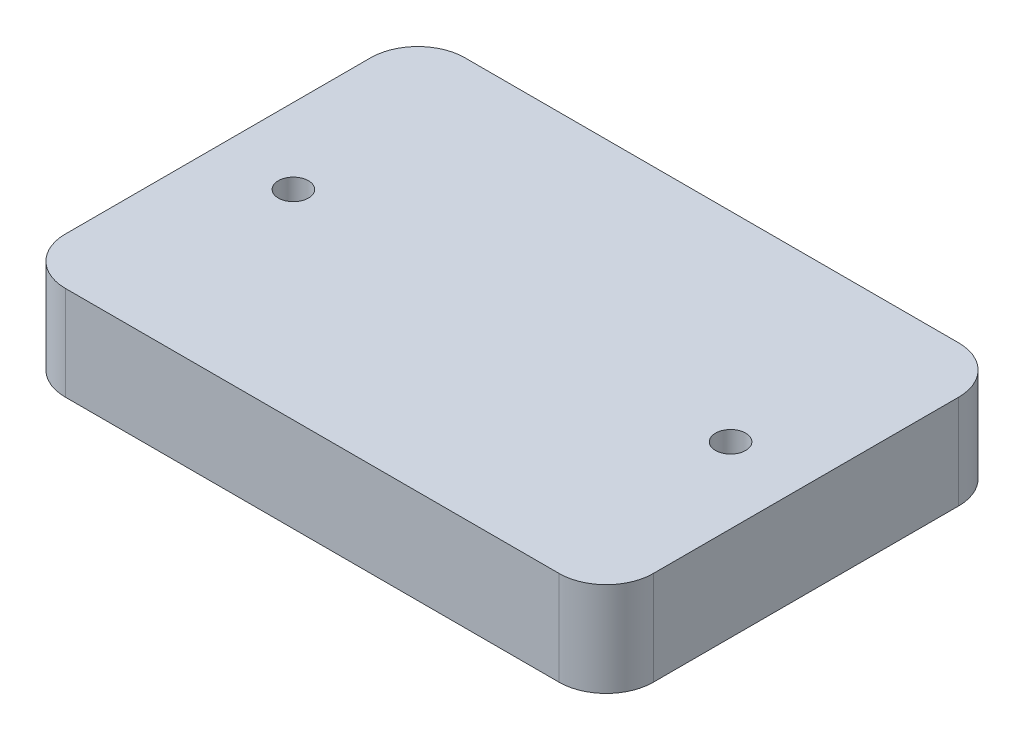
from build123d import *

# Parameters (mm, degrees)
ESQUISSE1_R        = 1.6
BOSS_EXTRU_1_DEPTH = 10


with BuildPart() as part:
    # Esquisse1 → Boss.-Extru.1 (new body)
    with BuildSketch(Plane(origin=(0, 0, 0), x_dir=(1, 0, 0), z_dir=(0, 1, 0))):
        with BuildLine():
            Line((0, 37.4), (52.4, 37.4))
            ThreePointArc((52.4, 37.4), (55.935533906, 35.935533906), (57.4, 32.4))
            Line((57.4, 32.4), (57.4, 0))
            ThreePointArc((57.4, 0), (55.935533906, -3.535533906), (52.4, -5))
            Line((52.4, -5), (0, -5))
            ThreePointArc((0, -5), (-3.535533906, -3.535533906), (-5, 0))
            Line((-5, 0), (-5, 32.4))
            ThreePointArc((-5, 32.4), (-3.535533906, 35.935533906), (0, 37.4))
        make_face()
        with Locations(Location((3, 16.2, 0), (0, 0, 270))):
            Circle(ESQUISSE1_R, mode=Mode.SUBTRACT)
        with Locations(Location((49.4, 16.2, 0), (0, 0, 90))):
            Circle(ESQUISSE1_R, mode=Mode.SUBTRACT)
    extrude(amount=BOSS_EXTRU_1_DEPTH)


solid = part.part
